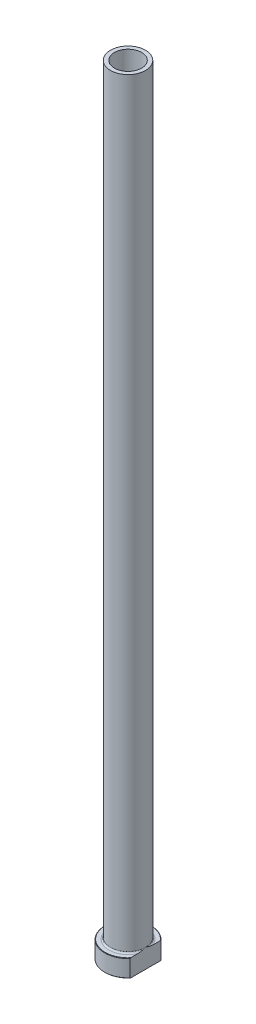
from build123d import *

# Parameters (mm, degrees)
FILLET1_R          = 0.8
CHAMFER1_SIZE      = 0.2
CUT_EXTRUDE1_DEPTH = 401.359838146
CHAMFER2_SIZE      = 0.5


with BuildPart() as part:
    # Sketch1 → Revolve1 (revolve)
    with BuildSketch(Plane.XY, mode=Mode.PRIVATE) as revolve1_sk:
        Polygon((-7, 400), (-9, 400), (-9, 9), (-12, 9), (-12, 0), (-7.25, 0), (-7.25, 333), (-7, 345), align=None)
    revolve(revolve1_sk.sketch.rotate(Axis((0, 92.187680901, 0), (0, -1, 0)), 270), axis=Axis((0, 92.187680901, 0), (0, -1, 0)))

    # Fillet1
    fillet1_edges = [part.edges().sort_by_distance(p)[0] for p in [
        (0, 9, -9),
    ]]
    fillet(fillet1_edges, radius=FILLET1_R)

    # Chamfer1
    chamfer1_edges = [part.edges().sort_by_distance(p)[0] for p in [
        (0, 0, -12),
        (0, 9, -12),
    ]]
    chamfer(chamfer1_edges, length=CHAMFER1_SIZE)

    # Sketch2 → Cut-Extrude1 (cut, through all)
    with BuildSketch(Plane.XZ):
        with BuildLine():
            Line((9, 7.937253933), (9, -7.937253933))
            ThreePointArc((9, -7.937253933), (12, 0), (9, 7.937253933))
        make_face()
    extrude(amount=-CUT_EXTRUDE1_DEPTH, mode=Mode.SUBTRACT)

    # Chamfer2
    chamfer2_edges = [part.edges().sort_by_distance(p)[0] for p in [
        (0, 0, -7.25),
    ]]
    chamfer(chamfer2_edges, length=CHAMFER2_SIZE)


solid = part.part
